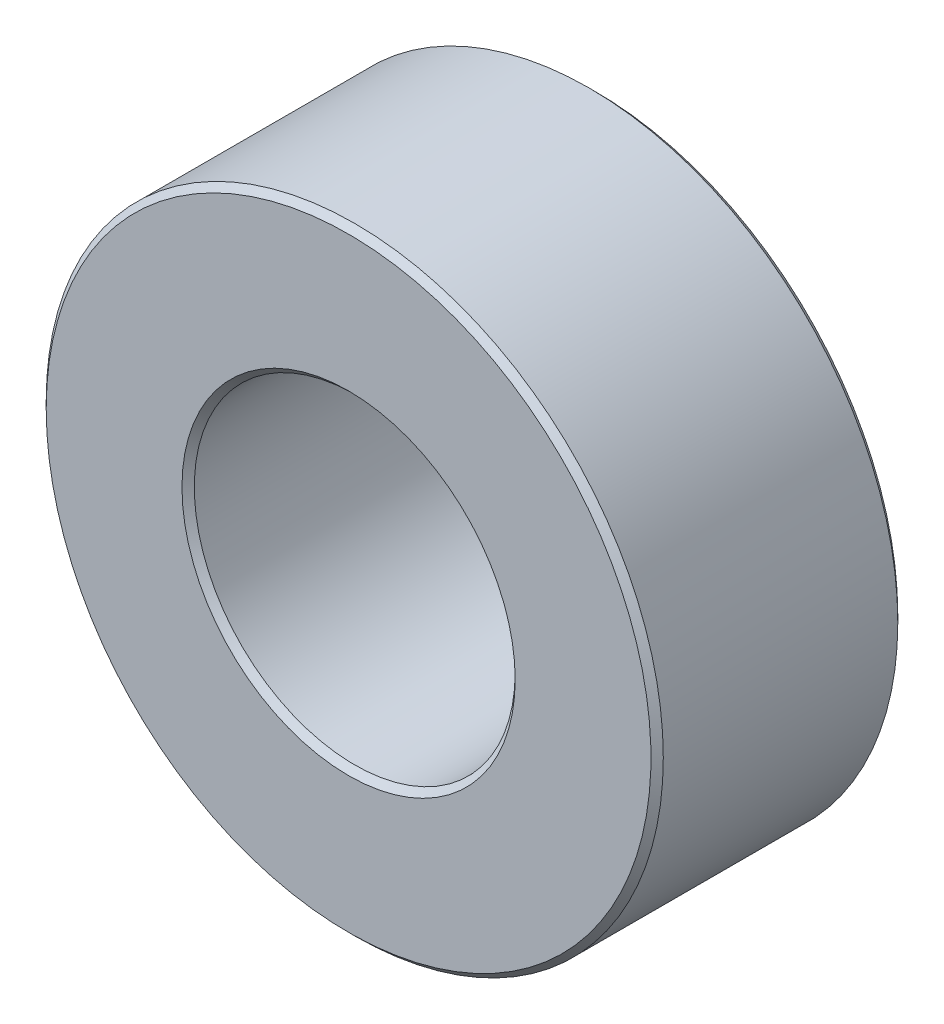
ISO-10303-21;
HEADER;
FILE_DESCRIPTION(('STEP AP214'),'2;1');
FILE_NAME('part.step','',(''),(''),'','','');
FILE_SCHEMA(('AUTOMOTIVE_DESIGN { 1 0 10303 214 1 1 1 1 }'));
ENDSEC;
DATA;
#1=APPLICATION_CONTEXT('core data for automotive mechanical design processes');
#2=APPLICATION_PROTOCOL_DEFINITION('international standard','automotive_design',2000,#1);
#3=PRODUCT_CONTEXT('',#1,'mechanical');
#4=PRODUCT('Part','Part','',(#3));
#5=PRODUCT_RELATED_PRODUCT_CATEGORY('part','',(#4));
#6=PRODUCT_DEFINITION_FORMATION('','',#4);
#7=PRODUCT_DEFINITION_CONTEXT('part definition',#1,'design');
#8=PRODUCT_DEFINITION('design','',#6,#7);
#9=PRODUCT_DEFINITION_SHAPE('','',#8);
#10=(LENGTH_UNIT() NAMED_UNIT(*) SI_UNIT(.MILLI.,.METRE.));
#11=(NAMED_UNIT(*) PLANE_ANGLE_UNIT() SI_UNIT($,.RADIAN.));
#12=(NAMED_UNIT(*) SI_UNIT($,.STERADIAN.) SOLID_ANGLE_UNIT());
#13=UNCERTAINTY_MEASURE_WITH_UNIT(LENGTH_MEASURE(1.E-05),#10,'distance_accuracy_value','');
#14=(GEOMETRIC_REPRESENTATION_CONTEXT(3) GLOBAL_UNCERTAINTY_ASSIGNED_CONTEXT((#13)) GLOBAL_UNIT_ASSIGNED_CONTEXT((#10,
#11,#12)) REPRESENTATION_CONTEXT('',''));
#15=CARTESIAN_POINT('',(0.,0.,0.));
#16=DIRECTION('',(0.,0.,1.));
#17=DIRECTION('',(1.,0.,0.));
#18=AXIS2_PLACEMENT_3D('',#15,#16,#17);
#19=CARTESIAN_POINT('',(0.,0.,2.));
#20=DIRECTION('',(0.,0.,1.));
#21=DIRECTION('',(1.,0.,0.));
#22=AXIS2_PLACEMENT_3D('',#19,#20,#21);
#23=PLANE('',#22);
#24=CARTESIAN_POINT('',(0.,0.,2.));
#25=DIRECTION('',(0.,0.,1.));
#26=DIRECTION('',(1.,0.,0.));
#27=AXIS2_PLACEMENT_3D('',#24,#25,#26);
#28=CIRCLE('',#27,2.7);
#29=CARTESIAN_POINT('',(2.7,0.,2.));
#30=VERTEX_POINT('',#29);
#31=EDGE_CURVE('E10',#30,#30,#28,.F.);
#32=ORIENTED_EDGE('',*,*,#31,.T.);
#33=EDGE_LOOP('',(#32));
#34=FACE_BOUND('',#33,.T.);
#35=CARTESIAN_POINT('',(0.,0.,2.));
#36=DIRECTION('',(0.,0.,1.));
#37=DIRECTION('',(1.,0.,0.));
#38=AXIS2_PLACEMENT_3D('',#35,#36,#37);
#39=CIRCLE('',#38,4.9);
#40=CARTESIAN_POINT('',(-4.9,0.,2.));
#41=VERTEX_POINT('',#40);
#42=EDGE_CURVE('E45',#41,#41,#39,.T.);
#43=ORIENTED_EDGE('',*,*,#42,.T.);
#44=EDGE_LOOP('',(#43));
#45=FACE_BOUND('',#44,.T.);
#46=ADVANCED_FACE('F37',(#34,#45),#23,.T.);
#47=CARTESIAN_POINT('',(0.,0.,-2.));
#48=DIRECTION('',(0.,0.,1.));
#49=DIRECTION('',(1.,0.,0.));
#50=AXIS2_PLACEMENT_3D('',#47,#48,#49);
#51=PLANE('',#50);
#52=CARTESIAN_POINT('',(0.,0.,-2.));
#53=DIRECTION('',(0.,0.,1.));
#54=DIRECTION('',(1.,0.,0.));
#55=AXIS2_PLACEMENT_3D('',#52,#53,#54);
#56=CIRCLE('',#55,4.9);
#57=CARTESIAN_POINT('',(4.9,0.,-2.));
#58=VERTEX_POINT('',#57);
#59=EDGE_CURVE('E63',#58,#58,#56,.F.);
#60=ORIENTED_EDGE('',*,*,#59,.T.);
#61=EDGE_LOOP('',(#60));
#62=FACE_BOUND('',#61,.T.);
#63=CARTESIAN_POINT('',(0.,0.,-2.));
#64=DIRECTION('',(0.,0.,1.));
#65=DIRECTION('',(1.,0.,0.));
#66=AXIS2_PLACEMENT_3D('',#63,#64,#65);
#67=CIRCLE('',#66,2.7);
#68=CARTESIAN_POINT('',(2.7,0.,-2.));
#69=VERTEX_POINT('',#68);
#70=EDGE_CURVE('E66',#69,#69,#67,.T.);
#71=ORIENTED_EDGE('',*,*,#70,.T.);
#72=EDGE_LOOP('',(#71));
#73=FACE_BOUND('',#72,.T.);
#74=ADVANCED_FACE('F89',(#62,#73),#51,.F.);
#75=CARTESIAN_POINT('',(0.,0.,2.));
#76=DIRECTION('',(0.,0.,-1.));
#77=DIRECTION('',(-1.,0.,0.));
#78=AXIS2_PLACEMENT_3D('',#75,#76,#77);
#79=CYLINDRICAL_SURFACE('',#78,5.);
#80=CARTESIAN_POINT('',(0.,0.,-1.9));
#81=DIRECTION('',(0.,0.,1.));
#82=DIRECTION('',(1.,0.,0.));
#83=AXIS2_PLACEMENT_3D('',#80,#81,#82);
#84=CIRCLE('',#83,5.);
#85=CARTESIAN_POINT('',(5.,0.,-1.9));
#86=VERTEX_POINT('',#85);
#87=EDGE_CURVE('E69',#86,#86,#84,.T.);
#88=ORIENTED_EDGE('',*,*,#87,.T.);
#89=EDGE_LOOP('',(#88));
#90=FACE_BOUND('',#89,.T.);
#91=CARTESIAN_POINT('',(0.,0.,1.9));
#92=DIRECTION('',(0.,0.,1.));
#93=DIRECTION('',(1.,0.,0.));
#94=AXIS2_PLACEMENT_3D('',#91,#92,#93);
#95=CIRCLE('',#94,5.);
#96=CARTESIAN_POINT('',(-5.,0.,1.9));
#97=VERTEX_POINT('',#96);
#98=EDGE_CURVE('E73',#97,#97,#95,.F.);
#99=ORIENTED_EDGE('',*,*,#98,.T.);
#100=EDGE_LOOP('',(#99));
#101=FACE_BOUND('',#100,.T.);
#102=ADVANCED_FACE('F78',(#90,#101),#79,.T.);
#103=CARTESIAN_POINT('',(0.,0.,2.));
#104=DIRECTION('',(0.,0.,-1.));
#105=DIRECTION('',(-1.,0.,0.));
#106=AXIS2_PLACEMENT_3D('',#103,#104,#105);
#107=CYLINDRICAL_SURFACE('',#106,2.6);
#108=CARTESIAN_POINT('',(0.,0.,-1.9));
#109=DIRECTION('',(0.,0.,1.));
#110=DIRECTION('',(1.,0.,0.));
#111=AXIS2_PLACEMENT_3D('',#108,#109,#110);
#112=CIRCLE('',#111,2.6);
#113=CARTESIAN_POINT('',(2.6,0.,-1.9));
#114=VERTEX_POINT('',#113);
#115=EDGE_CURVE('E52',#114,#114,#112,.F.);
#116=ORIENTED_EDGE('',*,*,#115,.T.);
#117=EDGE_LOOP('',(#116));
#118=FACE_BOUND('',#117,.T.);
#119=CARTESIAN_POINT('',(0.,0.,1.9));
#120=DIRECTION('',(0.,0.,1.));
#121=DIRECTION('',(1.,0.,0.));
#122=AXIS2_PLACEMENT_3D('',#119,#120,#121);
#123=CIRCLE('',#122,2.6);
#124=CARTESIAN_POINT('',(2.6,0.,1.9));
#125=VERTEX_POINT('',#124);
#126=EDGE_CURVE('E57',#125,#125,#123,.T.);
#127=ORIENTED_EDGE('',*,*,#126,.T.);
#128=EDGE_LOOP('',(#127));
#129=FACE_BOUND('',#128,.T.);
#130=ADVANCED_FACE('F97',(#118,#129),#107,.F.);
#131=CARTESIAN_POINT('',(0.,0.,-1.9));
#132=DIRECTION('',(0.,0.,1.));
#133=DIRECTION('',(1.,0.,0.));
#134=AXIS2_PLACEMENT_3D('',#131,#132,#133);
#135=CONICAL_SURFACE('',#134,5.,0.785398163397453);
#136=ORIENTED_EDGE('',*,*,#59,.F.);
#137=EDGE_LOOP('',(#136));
#138=FACE_BOUND('',#137,.T.);
#139=ORIENTED_EDGE('',*,*,#87,.F.);
#140=EDGE_LOOP('',(#139));
#141=FACE_BOUND('',#140,.T.);
#142=ADVANCED_FACE('F102',(#138,#141),#135,.T.);
#143=CARTESIAN_POINT('',(0.,0.,-2.));
#144=DIRECTION('',(0.,0.,-1.));
#145=DIRECTION('',(-1.,0.,0.));
#146=AXIS2_PLACEMENT_3D('',#143,#144,#145);
#147=CONICAL_SURFACE('',#146,2.7,0.785398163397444);
#148=ORIENTED_EDGE('',*,*,#115,.F.);
#149=EDGE_LOOP('',(#148));
#150=FACE_BOUND('',#149,.T.);
#151=ORIENTED_EDGE('',*,*,#70,.F.);
#152=EDGE_LOOP('',(#151));
#153=FACE_BOUND('',#152,.T.);
#154=ADVANCED_FACE('F86',(#150,#153),#147,.F.);
#155=CARTESIAN_POINT('',(0.,0.,1.9));
#156=DIRECTION('',(0.,0.,1.));
#157=DIRECTION('',(1.,0.,0.));
#158=AXIS2_PLACEMENT_3D('',#155,#156,#157);
#159=CONICAL_SURFACE('',#158,2.6,0.785398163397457);
#160=ORIENTED_EDGE('',*,*,#31,.F.);
#161=EDGE_LOOP('',(#160));
#162=FACE_BOUND('',#161,.T.);
#163=ORIENTED_EDGE('',*,*,#126,.F.);
#164=EDGE_LOOP('',(#163));
#165=FACE_BOUND('',#164,.T.);
#166=ADVANCED_FACE('F82',(#162,#165),#159,.F.);
#167=CARTESIAN_POINT('',(0.,0.,2.));
#168=DIRECTION('',(0.,0.,-1.));
#169=DIRECTION('',(-1.,0.,0.));
#170=AXIS2_PLACEMENT_3D('',#167,#168,#169);
#171=CONICAL_SURFACE('',#170,4.9,0.785398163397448);
#172=CARTESIAN_POINT('',(-5.,0.,1.9));
#173=CARTESIAN_POINT('',(-4.99895833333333,0.,1.90104166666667));
#174=CARTESIAN_POINT('',(-4.99791666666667,0.,1.90208333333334));
#175=CARTESIAN_POINT('',(-4.99583333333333,0.,1.90416666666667));
#176=CARTESIAN_POINT('',(-4.99479166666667,0.,1.90520833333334));
#177=CARTESIAN_POINT('',(-4.99270833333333,0.,1.90729166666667));
#178=CARTESIAN_POINT('',(-4.99166666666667,0.,1.90833333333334));
#179=CARTESIAN_POINT('',(-4.98958333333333,0.,1.91041666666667));
#180=CARTESIAN_POINT('',(-4.98854166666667,0.,1.91145833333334));
#181=CARTESIAN_POINT('',(-4.98645833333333,0.,1.91354166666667));
#182=CARTESIAN_POINT('',(-4.98541666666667,0.,1.91458333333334));
#183=CARTESIAN_POINT('',(-4.98333333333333,0.,1.91666666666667));
#184=CARTESIAN_POINT('',(-4.98229166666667,0.,1.91770833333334));
#185=CARTESIAN_POINT('',(-4.98020833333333,0.,1.91979166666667));
#186=CARTESIAN_POINT('',(-4.97916666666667,0.,1.92083333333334));
#187=CARTESIAN_POINT('',(-4.97708333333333,0.,1.92291666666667));
#188=CARTESIAN_POINT('',(-4.97604166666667,0.,1.92395833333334));
#189=CARTESIAN_POINT('',(-4.97395833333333,0.,1.92604166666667));
#190=CARTESIAN_POINT('',(-4.97291666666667,0.,1.92708333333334));
#191=CARTESIAN_POINT('',(-4.97083333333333,0.,1.92916666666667));
#192=CARTESIAN_POINT('',(-4.96979166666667,0.,1.93020833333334));
#193=CARTESIAN_POINT('',(-4.96770833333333,0.,1.93229166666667));
#194=CARTESIAN_POINT('',(-4.96666666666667,0.,1.93333333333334));
#195=CARTESIAN_POINT('',(-4.96458333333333,0.,1.93541666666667));
#196=CARTESIAN_POINT('',(-4.96354166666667,0.,1.93645833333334));
#197=CARTESIAN_POINT('',(-4.96145833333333,0.,1.93854166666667));
#198=CARTESIAN_POINT('',(-4.96041666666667,0.,1.93958333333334));
#199=CARTESIAN_POINT('',(-4.95833333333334,0.,1.94166666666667));
#200=CARTESIAN_POINT('',(-4.95729166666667,0.,1.94270833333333));
#201=CARTESIAN_POINT('',(-4.95520833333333,0.,1.94479166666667));
#202=CARTESIAN_POINT('',(-4.95416666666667,0.,1.94583333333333));
#203=CARTESIAN_POINT('',(-4.95208333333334,0.,1.94791666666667));
#204=CARTESIAN_POINT('',(-4.95104166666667,0.,1.94895833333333));
#205=CARTESIAN_POINT('',(-4.94895833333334,0.,1.95104166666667));
#206=CARTESIAN_POINT('',(-4.94791666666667,0.,1.95208333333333));
#207=CARTESIAN_POINT('',(-4.94583333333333,0.,1.95416666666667));
#208=CARTESIAN_POINT('',(-4.94479166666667,0.,1.95520833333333));
#209=CARTESIAN_POINT('',(-4.94270833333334,0.,1.95729166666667));
#210=CARTESIAN_POINT('',(-4.94166666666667,0.,1.95833333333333));
#211=CARTESIAN_POINT('',(-4.93958333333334,0.,1.96041666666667));
#212=CARTESIAN_POINT('',(-4.93854166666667,0.,1.96145833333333));
#213=CARTESIAN_POINT('',(-4.93645833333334,0.,1.96354166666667));
#214=CARTESIAN_POINT('',(-4.93541666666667,0.,1.96458333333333));
#215=CARTESIAN_POINT('',(-4.93333333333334,0.,1.96666666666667));
#216=CARTESIAN_POINT('',(-4.93229166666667,0.,1.96770833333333));
#217=CARTESIAN_POINT('',(-4.93020833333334,0.,1.96979166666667));
#218=CARTESIAN_POINT('',(-4.92916666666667,0.,1.97083333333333));
#219=CARTESIAN_POINT('',(-4.92708333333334,0.,1.97291666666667));
#220=CARTESIAN_POINT('',(-4.92604166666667,0.,1.97395833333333));
#221=CARTESIAN_POINT('',(-4.92395833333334,0.,1.97604166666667));
#222=CARTESIAN_POINT('',(-4.92291666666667,0.,1.97708333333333));
#223=CARTESIAN_POINT('',(-4.92083333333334,0.,1.97916666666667));
#224=CARTESIAN_POINT('',(-4.91979166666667,0.,1.98020833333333));
#225=CARTESIAN_POINT('',(-4.91770833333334,0.,1.98229166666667));
#226=CARTESIAN_POINT('',(-4.91666666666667,0.,1.98333333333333));
#227=CARTESIAN_POINT('',(-4.91458333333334,0.,1.98541666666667));
#228=CARTESIAN_POINT('',(-4.91354166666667,0.,1.98645833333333));
#229=CARTESIAN_POINT('',(-4.91145833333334,0.,1.98854166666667));
#230=CARTESIAN_POINT('',(-4.91041666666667,0.,1.98958333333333));
#231=CARTESIAN_POINT('',(-4.90833333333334,0.,1.99166666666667));
#232=CARTESIAN_POINT('',(-4.90729166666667,0.,1.99270833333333));
#233=CARTESIAN_POINT('',(-4.90520833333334,0.,1.99479166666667));
#234=CARTESIAN_POINT('',(-4.90416666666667,0.,1.99583333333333));
#235=CARTESIAN_POINT('',(-4.90208333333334,0.,1.99791666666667));
#236=CARTESIAN_POINT('',(-4.90104166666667,0.,1.99895833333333));
#237=CARTESIAN_POINT('',(-4.9,0.,2.));
#238=B_SPLINE_CURVE_WITH_KNOTS('',3,(#172,#173,#174,#175,#176,#177,#178,#179,#180,#181,#182,
#183,#184,#185,#186,#187,#188,#189,#190,#191,#192,#193,#194,#195,#196,#197,#198,#199,#200,#201,
#202,#203,#204,#205,#206,#207,#208,#209,#210,#211,#212,#213,#214,#215,#216,#217,#218,#219,#220,
#221,#222,#223,#224,#225,#226,#227,#228,#229,#230,#231,#232,#233,#234,#235,#236,#237),
.UNSPECIFIED.,.F.,.F.,(4,2,2,2,2,2,2,2,2,2,2,2,2,2,2,2,2,2,2,2,2,2,2,2,2,2,2,2,2,2,2,2,4),(0.,
0.00441941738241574,0.00883883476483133,0.0132582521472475,0.0176776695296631,
0.0220970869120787,0.0265165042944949,0.0309359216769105,0.0353553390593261,0.0397747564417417,
0.044194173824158,0.0486135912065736,0.0530330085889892,0.0574524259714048,0.061871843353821,
0.0662912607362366,0.0707106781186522,0.0751300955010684,0.0795495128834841,0.0839689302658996,
0.0883883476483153,0.0928077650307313,0.0972271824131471,0.101646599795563,0.106066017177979,
0.110485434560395,0.11490485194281,0.119324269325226,0.123743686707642,0.128163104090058,
0.132582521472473,0.137001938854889,0.141421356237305),.UNSPECIFIED.);
#239=EDGE_CURVE('BSEAM39',#97,#41,#238,.T.);
#240=ORIENTED_EDGE('',*,*,#98,.F.);
#241=ORIENTED_EDGE('',*,*,#42,.F.);
#242=ORIENTED_EDGE('',*,*,#239,.T.);
#243=ORIENTED_EDGE('',*,*,#239,.F.);
#244=EDGE_LOOP('',(#240,#242,#241,#243));
#245=FACE_BOUND('',#244,.T.);
#246=ADVANCED_FACE('F39',(#245),#171,.T.);
#247=CLOSED_SHELL('',(#46,#74,#102,#130,#142,#154,#166,#246));
#248=MANIFOLD_SOLID_BREP('B2',#247);
#249=ADVANCED_BREP_SHAPE_REPRESENTATION('',(#18,#248),#14);
#250=SHAPE_DEFINITION_REPRESENTATION(#9,#249);
ENDSEC;
END-ISO-10303-21;
